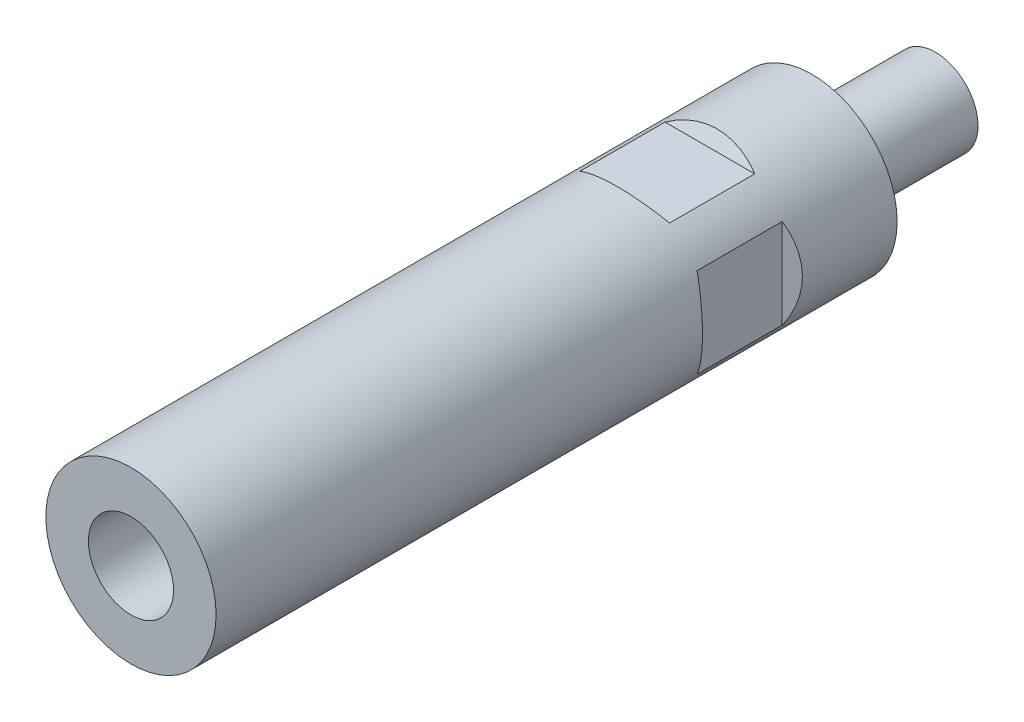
ISO-10303-21;
HEADER;
FILE_DESCRIPTION(('STEP AP214'),'2;1');
FILE_NAME('part.step','',(''),(''),'','','');
FILE_SCHEMA(('AUTOMOTIVE_DESIGN { 1 0 10303 214 1 1 1 1 }'));
ENDSEC;
DATA;
#1=APPLICATION_CONTEXT('core data for automotive mechanical design processes');
#2=APPLICATION_PROTOCOL_DEFINITION('international standard','automotive_design',2000,#1);
#3=PRODUCT_CONTEXT('',#1,'mechanical');
#4=PRODUCT('Part','Part','',(#3));
#5=PRODUCT_RELATED_PRODUCT_CATEGORY('part','',(#4));
#6=PRODUCT_DEFINITION_FORMATION('','',#4);
#7=PRODUCT_DEFINITION_CONTEXT('part definition',#1,'design');
#8=PRODUCT_DEFINITION('design','',#6,#7);
#9=PRODUCT_DEFINITION_SHAPE('','',#8);
#10=(LENGTH_UNIT() NAMED_UNIT(*) SI_UNIT(.MILLI.,.METRE.));
#11=(NAMED_UNIT(*) PLANE_ANGLE_UNIT() SI_UNIT($,.RADIAN.));
#12=(NAMED_UNIT(*) SI_UNIT($,.STERADIAN.) SOLID_ANGLE_UNIT());
#13=UNCERTAINTY_MEASURE_WITH_UNIT(LENGTH_MEASURE(1.E-05),#10,'distance_accuracy_value','');
#14=(GEOMETRIC_REPRESENTATION_CONTEXT(3) GLOBAL_UNCERTAINTY_ASSIGNED_CONTEXT((#13)) GLOBAL_UNIT_ASSIGNED_CONTEXT((#10,
#11,#12)) REPRESENTATION_CONTEXT('',''));
#15=CARTESIAN_POINT('',(0.,0.,0.));
#16=DIRECTION('',(0.,0.,1.));
#17=DIRECTION('',(1.,0.,0.));
#18=AXIS2_PLACEMENT_3D('',#15,#16,#17);
#19=CARTESIAN_POINT('',(0.,0.,5.5));
#20=DIRECTION('',(0.,0.,1.));
#21=DIRECTION('',(0.,-1.,0.));
#22=AXIS2_PLACEMENT_3D('',#19,#20,#21);
#23=CYLINDRICAL_SURFACE('',#22,5.);
#24=CARTESIAN_POINT('',(0.,0.,-14.5));
#25=DIRECTION('',(0.,0.,1.));
#26=DIRECTION('',(0.,-1.,0.));
#27=AXIS2_PLACEMENT_3D('',#24,#25,#26);
#28=CIRCLE('',#27,5.);
#29=CARTESIAN_POINT('',(0.,-5.,-14.5));
#30=VERTEX_POINT('',#29);
#31=EDGE_CURVE('E22',#30,#30,#28,.F.);
#32=ORIENTED_EDGE('',*,*,#31,.F.);
#33=EDGE_LOOP('',(#32));
#34=FACE_BOUND('',#33,.T.);
#35=CARTESIAN_POINT('',(0.,0.,0.));
#36=DIRECTION('',(0.,0.,1.));
#37=DIRECTION('',(1.,0.,0.));
#38=AXIS2_PLACEMENT_3D('',#35,#36,#37);
#39=CIRCLE('',#38,5.);
#40=CARTESIAN_POINT('',(5.,0.,0.));
#41=VERTEX_POINT('',#40);
#42=EDGE_CURVE('E9',#41,#41,#39,.T.);
#43=ORIENTED_EDGE('',*,*,#42,.F.);
#44=EDGE_LOOP('',(#43));
#45=FACE_BOUND('',#44,.T.);
#46=ADVANCED_FACE('F14',(#34,#45),#23,.T.);
#47=CARTESIAN_POINT('',(0.,0.,-14.5));
#48=DIRECTION('',(0.,0.,1.));
#49=DIRECTION('',(0.,-1.,0.));
#50=AXIS2_PLACEMENT_3D('',#47,#48,#49);
#51=PLANE('',#50);
#52=ORIENTED_EDGE('',*,*,#31,.T.);
#53=EDGE_LOOP('',(#52));
#54=FACE_BOUND('',#53,.T.);
#55=ADVANCED_FACE('F16',(#54),#51,.F.);
#56=CARTESIAN_POINT('',(4.25,4.36432032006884E-13,55.));
#57=DIRECTION('',(0.,0.,-1.));
#58=DIRECTION('',(-1.,0.,0.));
#59=AXIS2_PLACEMENT_3D('',#56,#57,#58);
#60=PLANE('',#59);
#61=CARTESIAN_POINT('',(0.,4.36432032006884E-13,55.));
#62=DIRECTION('',(0.,0.,1.));
#63=DIRECTION('',(1.,0.,0.));
#64=AXIS2_PLACEMENT_3D('',#61,#62,#63);
#65=CIRCLE('',#64,5.);
#66=CARTESIAN_POINT('',(5.,4.36432032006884E-13,55.));
#67=VERTEX_POINT('',#66);
#68=EDGE_CURVE('E251',#67,#67,#65,.T.);
#69=ORIENTED_EDGE('',*,*,#68,.T.);
#70=EDGE_LOOP('',(#69));
#71=FACE_BOUND('',#70,.T.);
#72=ADVANCED_FACE('F125',(#71),#60,.F.);
#73=CARTESIAN_POINT('',(0.,4.36432032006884E-13,80.));
#74=DIRECTION('',(0.,0.,1.));
#75=DIRECTION('',(1.,0.,0.));
#76=AXIS2_PLACEMENT_3D('',#73,#74,#75);
#77=CYLINDRICAL_SURFACE('',#76,5.);
#78=ORIENTED_EDGE('',*,*,#68,.F.);
#79=EDGE_LOOP('',(#78));
#80=FACE_BOUND('',#79,.T.);
#81=CARTESIAN_POINT('',(0.,4.36432032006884E-13,80.));
#82=DIRECTION('',(0.,0.,1.));
#83=DIRECTION('',(1.,0.,0.));
#84=AXIS2_PLACEMENT_3D('',#81,#82,#83);
#85=CIRCLE('',#84,5.);
#86=CARTESIAN_POINT('',(5.,4.36432032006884E-13,80.));
#87=VERTEX_POINT('',#86);
#88=EDGE_CURVE('E96',#87,#87,#85,.T.);
#89=ORIENTED_EDGE('',*,*,#88,.T.);
#90=EDGE_LOOP('',(#89));
#91=FACE_BOUND('',#90,.T.);
#92=ADVANCED_FACE('F127',(#80,#91),#77,.F.);
#93=CARTESIAN_POINT('',(0.,0.,80.));
#94=DIRECTION('',(0.,0.,1.));
#95=DIRECTION('',(1.,0.,0.));
#96=AXIS2_PLACEMENT_3D('',#93,#94,#95);
#97=PLANE('',#96);
#98=ORIENTED_EDGE('',*,*,#88,.F.);
#99=EDGE_LOOP('',(#98));
#100=FACE_BOUND('',#99,.T.);
#101=CARTESIAN_POINT('',(0.,0.,80.));
#102=DIRECTION('',(0.,0.,1.));
#103=DIRECTION('',(1.,0.,0.));
#104=AXIS2_PLACEMENT_3D('',#101,#102,#103);
#105=CIRCLE('',#104,10.);
#106=CARTESIAN_POINT('',(10.,0.,80.));
#107=VERTEX_POINT('',#106);
#108=EDGE_CURVE('E239',#107,#107,#105,.T.);
#109=ORIENTED_EDGE('',*,*,#108,.T.);
#110=EDGE_LOOP('',(#109));
#111=FACE_BOUND('',#110,.T.);
#112=ADVANCED_FACE('F134',(#100,#111),#97,.T.);
#113=CARTESIAN_POINT('',(8.5,-10.,22.));
#114=DIRECTION('',(-0.5,0.,0.866025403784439));
#115=DIRECTION('',(0.866025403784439,0.,0.5));
#116=AXIS2_PLACEMENT_3D('',#113,#114,#115);
#117=PLANE('',#116);
#118=DIRECTION('',(0.,1.,0.));
#119=VECTOR('',#118,1.);
#120=CARTESIAN_POINT('',(8.5,-10.,22.));
#121=LINE('',#120,#119);
#122=CARTESIAN_POINT('',(8.5,-5.26782687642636,22.));
#123=VERTEX_POINT('',#122);
#124=CARTESIAN_POINT('',(8.5,5.26782687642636,22.));
#125=VERTEX_POINT('',#124);
#126=EDGE_CURVE('E183',#123,#125,#121,.T.);
#127=ORIENTED_EDGE('',*,*,#126,.T.);
#128=CARTESIAN_POINT('',(0.,0.,17.0925227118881));
#129=DIRECTION('',(-0.5,0.,0.866025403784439));
#130=DIRECTION('',(-0.866025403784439,0.,-0.5));
#131=AXIS2_PLACEMENT_3D('',#128,#129,#130);
#132=ELLIPSE('',#131,11.5470053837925,10.);
#133=EDGE_CURVE('E35',#123,#125,#132,.T.);
#134=ORIENTED_EDGE('',*,*,#133,.F.);
#135=EDGE_LOOP('',(#127,#134));
#136=FACE_BOUND('',#135,.T.);
#137=ADVANCED_FACE('F175',(#136),#117,.F.);
#138=CARTESIAN_POINT('',(8.5,-10.,22.));
#139=DIRECTION('',(-1.,0.,0.));
#140=DIRECTION('',(0.,0.,1.));
#141=AXIS2_PLACEMENT_3D('',#138,#139,#140);
#142=PLANE('',#141);
#143=ORIENTED_EDGE('',*,*,#126,.F.);
#144=DIRECTION('',(0.,0.,-1.));
#145=VECTOR('',#144,1.);
#146=CARTESIAN_POINT('',(8.5,-5.26782687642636,80.));
#147=LINE('',#146,#145);
#148=CARTESIAN_POINT('',(8.5,-5.26782687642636,12.));
#149=VERTEX_POINT('',#148);
#150=EDGE_CURVE('E191',#149,#123,#147,.F.);
#151=ORIENTED_EDGE('',*,*,#150,.F.);
#152=DIRECTION('',(0.,1.,0.));
#153=VECTOR('',#152,1.);
#154=CARTESIAN_POINT('',(8.5,-10.,12.));
#155=LINE('',#154,#153);
#156=CARTESIAN_POINT('',(8.5,5.26782687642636,12.));
#157=VERTEX_POINT('',#156);
#158=EDGE_CURVE('E187',#149,#157,#155,.T.);
#159=ORIENTED_EDGE('',*,*,#158,.T.);
#160=DIRECTION('',(0.,0.,-1.));
#161=VECTOR('',#160,1.);
#162=CARTESIAN_POINT('',(8.5,5.26782687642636,80.));
#163=LINE('',#162,#161);
#164=EDGE_CURVE('E29',#125,#157,#163,.T.);
#165=ORIENTED_EDGE('',*,*,#164,.F.);
#166=EDGE_LOOP('',(#143,#151,#159,#165));
#167=FACE_BOUND('',#166,.T.);
#168=ADVANCED_FACE('F172',(#167),#142,.F.);
#169=CARTESIAN_POINT('',(8.5,-10.,12.));
#170=DIRECTION('',(-0.5,0.,-0.866025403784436));
#171=DIRECTION('',(-0.866025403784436,0.,0.5));
#172=AXIS2_PLACEMENT_3D('',#169,#170,#171);
#173=PLANE('',#172);
#174=CARTESIAN_POINT('',(0.,0.,16.9074772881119));
#175=DIRECTION('',(-0.5,0.,-0.866025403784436));
#176=DIRECTION('',(0.866025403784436,0.,-0.5));
#177=AXIS2_PLACEMENT_3D('',#174,#175,#176);
#178=ELLIPSE('',#177,11.5470053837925,10.);
#179=EDGE_CURVE('E195',#157,#149,#178,.T.);
#180=ORIENTED_EDGE('',*,*,#179,.F.);
#181=ORIENTED_EDGE('',*,*,#158,.F.);
#182=EDGE_LOOP('',(#180,#181));
#183=FACE_BOUND('',#182,.T.);
#184=ADVANCED_FACE('F167',(#183),#173,.F.);
#185=CARTESIAN_POINT('',(-8.5,-10.,12.));
#186=DIRECTION('',(0.5,0.,-0.866025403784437));
#187=DIRECTION('',(-0.866025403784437,0.,-0.5));
#188=AXIS2_PLACEMENT_3D('',#185,#186,#187);
#189=PLANE('',#188);
#190=CARTESIAN_POINT('',(0.,0.,16.9074772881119));
#191=DIRECTION('',(0.5,0.,-0.866025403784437));
#192=DIRECTION('',(-0.866025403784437,0.,-0.5));
#193=AXIS2_PLACEMENT_3D('',#190,#191,#192);
#194=ELLIPSE('',#193,11.5470053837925,10.);
#195=CARTESIAN_POINT('',(-8.5,-5.26782687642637,12.));
#196=VERTEX_POINT('',#195);
#197=CARTESIAN_POINT('',(-8.5,5.26782687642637,12.));
#198=VERTEX_POINT('',#197);
#199=EDGE_CURVE('E193',#196,#198,#194,.T.);
#200=ORIENTED_EDGE('',*,*,#199,.F.);
#201=DIRECTION('',(0.,1.,0.));
#202=VECTOR('',#201,1.);
#203=CARTESIAN_POINT('',(-8.5,-10.,12.));
#204=LINE('',#203,#202);
#205=EDGE_CURVE('E227',#196,#198,#204,.T.);
#206=ORIENTED_EDGE('',*,*,#205,.T.);
#207=EDGE_LOOP('',(#200,#206));
#208=FACE_BOUND('',#207,.T.);
#209=ADVANCED_FACE('F163',(#208),#189,.F.);
#210=CARTESIAN_POINT('',(-8.5,-10.,22.));
#211=DIRECTION('',(0.5,0.,0.866025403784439));
#212=DIRECTION('',(0.866025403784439,0.,-0.5));
#213=AXIS2_PLACEMENT_3D('',#210,#211,#212);
#214=PLANE('',#213);
#215=DIRECTION('',(0.,1.,0.));
#216=VECTOR('',#215,1.);
#217=CARTESIAN_POINT('',(-8.5,-10.,22.));
#218=LINE('',#217,#216);
#219=CARTESIAN_POINT('',(-8.5,-5.26782687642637,22.));
#220=VERTEX_POINT('',#219);
#221=CARTESIAN_POINT('',(-8.5,5.26782687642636,22.));
#222=VERTEX_POINT('',#221);
#223=EDGE_CURVE('E231',#220,#222,#218,.T.);
#224=ORIENTED_EDGE('',*,*,#223,.F.);
#225=CARTESIAN_POINT('',(0.,0.,17.0925227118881));
#226=DIRECTION('',(0.5,0.,0.866025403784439));
#227=DIRECTION('',(0.866025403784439,0.,-0.5));
#228=AXIS2_PLACEMENT_3D('',#225,#226,#227);
#229=ELLIPSE('',#228,11.5470053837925,10.);
#230=EDGE_CURVE('E206',#222,#220,#229,.T.);
#231=ORIENTED_EDGE('',*,*,#230,.F.);
#232=EDGE_LOOP('',(#224,#231));
#233=FACE_BOUND('',#232,.T.);
#234=ADVANCED_FACE('F160',(#233),#214,.F.);
#235=CARTESIAN_POINT('',(-8.5,-10.,22.));
#236=DIRECTION('',(1.,0.,0.));
#237=DIRECTION('',(0.,0.,-1.));
#238=AXIS2_PLACEMENT_3D('',#235,#236,#237);
#239=PLANE('',#238);
#240=ORIENTED_EDGE('',*,*,#223,.T.);
#241=DIRECTION('',(0.,0.,-1.));
#242=VECTOR('',#241,1.);
#243=CARTESIAN_POINT('',(-8.5,5.26782687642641,80.));
#244=LINE('',#243,#242);
#245=EDGE_CURVE('E200',#198,#222,#244,.F.);
#246=ORIENTED_EDGE('',*,*,#245,.F.);
#247=ORIENTED_EDGE('',*,*,#205,.F.);
#248=DIRECTION('',(0.,0.,-1.));
#249=VECTOR('',#248,1.);
#250=CARTESIAN_POINT('',(-8.5,-5.26782687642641,80.));
#251=LINE('',#250,#249);
#252=EDGE_CURVE('E203',#220,#196,#251,.T.);
#253=ORIENTED_EDGE('',*,*,#252,.F.);
#254=EDGE_LOOP('',(#240,#246,#247,#253));
#255=FACE_BOUND('',#254,.T.);
#256=ADVANCED_FACE('F158',(#255),#239,.F.);
#257=CARTESIAN_POINT('',(10.,8.5,22.));
#258=DIRECTION('',(0.,-0.5,0.866025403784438));
#259=DIRECTION('',(0.,-0.866025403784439,-0.5));
#260=AXIS2_PLACEMENT_3D('',#257,#258,#259);
#261=PLANE('',#260);
#262=DIRECTION('',(-1.,0.,0.));
#263=VECTOR('',#262,1.);
#264=CARTESIAN_POINT('',(10.,8.5,22.));
#265=LINE('',#264,#263);
#266=CARTESIAN_POINT('',(5.26782687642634,8.5,22.));
#267=VERTEX_POINT('',#266);
#268=CARTESIAN_POINT('',(-5.26782687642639,8.5,22.));
#269=VERTEX_POINT('',#268);
#270=EDGE_CURVE('E225',#267,#269,#265,.T.);
#271=ORIENTED_EDGE('',*,*,#270,.T.);
#272=CARTESIAN_POINT('',(0.,0.,17.0925227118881));
#273=DIRECTION('',(0.,-0.5,0.866025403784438));
#274=DIRECTION('',(0.,-0.866025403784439,-0.5));
#275=AXIS2_PLACEMENT_3D('',#272,#273,#274);
#276=ELLIPSE('',#275,11.5470053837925,10.);
#277=EDGE_CURVE('E214',#267,#269,#276,.T.);
#278=ORIENTED_EDGE('',*,*,#277,.F.);
#279=EDGE_LOOP('',(#271,#278));
#280=FACE_BOUND('',#279,.T.);
#281=ADVANCED_FACE('F151',(#280),#261,.F.);
#282=CARTESIAN_POINT('',(10.,8.5,22.));
#283=DIRECTION('',(0.,-1.,0.));
#284=DIRECTION('',(1.,0.,0.));
#285=AXIS2_PLACEMENT_3D('',#282,#283,#284);
#286=PLANE('',#285);
#287=ORIENTED_EDGE('',*,*,#270,.F.);
#288=DIRECTION('',(0.,0.,-1.));
#289=VECTOR('',#288,1.);
#290=CARTESIAN_POINT('',(5.26782687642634,8.5,80.));
#291=LINE('',#290,#289);
#292=CARTESIAN_POINT('',(5.26782687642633,8.5,12.));
#293=VERTEX_POINT('',#292);
#294=EDGE_CURVE('E88',#293,#267,#291,.F.);
#295=ORIENTED_EDGE('',*,*,#294,.F.);
#296=DIRECTION('',(-1.,0.,0.));
#297=VECTOR('',#296,1.);
#298=CARTESIAN_POINT('',(10.,8.5,12.));
#299=LINE('',#298,#297);
#300=CARTESIAN_POINT('',(-5.26782687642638,8.5,12.));
#301=VERTEX_POINT('',#300);
#302=EDGE_CURVE('E223',#293,#301,#299,.T.);
#303=ORIENTED_EDGE('',*,*,#302,.T.);
#304=DIRECTION('',(0.,0.,-1.));
#305=VECTOR('',#304,1.);
#306=CARTESIAN_POINT('',(-5.2678268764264,8.5,80.));
#307=LINE('',#306,#305);
#308=EDGE_CURVE('E211',#269,#301,#307,.T.);
#309=ORIENTED_EDGE('',*,*,#308,.F.);
#310=EDGE_LOOP('',(#287,#295,#303,#309));
#311=FACE_BOUND('',#310,.T.);
#312=ADVANCED_FACE('F148',(#311),#286,.F.);
#313=CARTESIAN_POINT('',(10.,8.5,12.));
#314=DIRECTION('',(0.,-0.5,-0.866025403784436));
#315=DIRECTION('',(0.,0.866025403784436,-0.5));
#316=AXIS2_PLACEMENT_3D('',#313,#314,#315);
#317=PLANE('',#316);
#318=CARTESIAN_POINT('',(0.,0.,16.9074772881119));
#319=DIRECTION('',(0.,-0.5,-0.866025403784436));
#320=DIRECTION('',(0.,0.866025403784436,-0.5));
#321=AXIS2_PLACEMENT_3D('',#318,#319,#320);
#322=ELLIPSE('',#321,11.5470053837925,10.);
#323=EDGE_CURVE('E209',#301,#293,#322,.T.);
#324=ORIENTED_EDGE('',*,*,#323,.F.);
#325=ORIENTED_EDGE('',*,*,#302,.F.);
#326=EDGE_LOOP('',(#324,#325));
#327=FACE_BOUND('',#326,.T.);
#328=ADVANCED_FACE('F145',(#327),#317,.F.);
#329=CARTESIAN_POINT('',(10.,-8.5,12.));
#330=DIRECTION('',(0.,0.5,-0.866025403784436));
#331=DIRECTION('',(0.,0.866025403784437,0.5));
#332=AXIS2_PLACEMENT_3D('',#329,#330,#331);
#333=PLANE('',#332);
#334=CARTESIAN_POINT('',(0.,0.,16.9074772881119));
#335=DIRECTION('',(0.,0.5,-0.866025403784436));
#336=DIRECTION('',(0.,-0.866025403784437,-0.5));
#337=AXIS2_PLACEMENT_3D('',#334,#335,#336);
#338=ELLIPSE('',#337,11.5470053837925,10.);
#339=CARTESIAN_POINT('',(5.2678268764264,-8.5,12.));
#340=VERTEX_POINT('',#339);
#341=CARTESIAN_POINT('',(-5.26782687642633,-8.5,12.));
#342=VERTEX_POINT('',#341);
#343=EDGE_CURVE('E79',#340,#342,#338,.T.);
#344=ORIENTED_EDGE('',*,*,#343,.F.);
#345=DIRECTION('',(-1.,0.,0.));
#346=VECTOR('',#345,1.);
#347=CARTESIAN_POINT('',(10.,-8.5,12.));
#348=LINE('',#347,#346);
#349=EDGE_CURVE('E82',#340,#342,#348,.T.);
#350=ORIENTED_EDGE('',*,*,#349,.T.);
#351=EDGE_LOOP('',(#344,#350));
#352=FACE_BOUND('',#351,.T.);
#353=ADVANCED_FACE('F81',(#352),#333,.F.);
#354=CARTESIAN_POINT('',(10.,-8.5,22.));
#355=DIRECTION('',(0.,0.5,0.866025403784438));
#356=DIRECTION('',(0.,-0.866025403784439,0.5));
#357=AXIS2_PLACEMENT_3D('',#354,#355,#356);
#358=PLANE('',#357);
#359=DIRECTION('',(-1.,0.,0.));
#360=VECTOR('',#359,1.);
#361=CARTESIAN_POINT('',(10.,-8.5,22.));
#362=LINE('',#361,#360);
#363=CARTESIAN_POINT('',(5.26782687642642,-8.5,22.));
#364=VERTEX_POINT('',#363);
#365=CARTESIAN_POINT('',(-5.26782687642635,-8.5,22.));
#366=VERTEX_POINT('',#365);
#367=EDGE_CURVE('E95',#364,#366,#362,.T.);
#368=ORIENTED_EDGE('',*,*,#367,.F.);
#369=CARTESIAN_POINT('',(0.,0.,17.0925227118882));
#370=DIRECTION('',(0.,0.5,0.866025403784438));
#371=DIRECTION('',(0.,0.866025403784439,-0.5));
#372=AXIS2_PLACEMENT_3D('',#369,#370,#371);
#373=ELLIPSE('',#372,11.5470053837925,10.);
#374=EDGE_CURVE('E101',#366,#364,#373,.T.);
#375=ORIENTED_EDGE('',*,*,#374,.F.);
#376=EDGE_LOOP('',(#368,#375));
#377=FACE_BOUND('',#376,.T.);
#378=ADVANCED_FACE('F139',(#377),#358,.F.);
#379=CARTESIAN_POINT('',(10.,-8.5,22.));
#380=DIRECTION('',(0.,1.,0.));
#381=DIRECTION('',(-1.,0.,0.));
#382=AXIS2_PLACEMENT_3D('',#379,#380,#381);
#383=PLANE('',#382);
#384=ORIENTED_EDGE('',*,*,#367,.T.);
#385=DIRECTION('',(0.,0.,-1.));
#386=VECTOR('',#385,1.);
#387=CARTESIAN_POINT('',(-5.26782687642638,-8.5,80.));
#388=LINE('',#387,#386);
#389=EDGE_CURVE('E87',#342,#366,#388,.F.);
#390=ORIENTED_EDGE('',*,*,#389,.F.);
#391=ORIENTED_EDGE('',*,*,#349,.F.);
#392=DIRECTION('',(0.,0.,-1.));
#393=VECTOR('',#392,1.);
#394=CARTESIAN_POINT('',(5.26782687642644,-8.5,80.));
#395=LINE('',#394,#393);
#396=EDGE_CURVE('E93',#364,#340,#395,.T.);
#397=ORIENTED_EDGE('',*,*,#396,.F.);
#398=EDGE_LOOP('',(#384,#390,#391,#397));
#399=FACE_BOUND('',#398,.T.);
#400=ADVANCED_FACE('F92',(#399),#383,.F.);
#401=CARTESIAN_POINT('',(0.,0.,80.));
#402=DIRECTION('',(0.,0.,-1.));
#403=DIRECTION('',(-1.,0.,0.));
#404=AXIS2_PLACEMENT_3D('',#401,#402,#403);
#405=CYLINDRICAL_SURFACE('',#404,10.);
#406=ORIENTED_EDGE('',*,*,#389,.T.);
#407=ORIENTED_EDGE('',*,*,#374,.T.);
#408=ORIENTED_EDGE('',*,*,#396,.T.);
#409=ORIENTED_EDGE('',*,*,#343,.T.);
#410=EDGE_LOOP('',(#406,#407,#408,#409));
#411=FACE_BOUND('',#410,.T.);
#412=ORIENTED_EDGE('',*,*,#323,.T.);
#413=ORIENTED_EDGE('',*,*,#294,.T.);
#414=ORIENTED_EDGE('',*,*,#277,.T.);
#415=ORIENTED_EDGE('',*,*,#308,.T.);
#416=EDGE_LOOP('',(#412,#413,#414,#415));
#417=FACE_BOUND('',#416,.T.);
#418=ORIENTED_EDGE('',*,*,#245,.T.);
#419=ORIENTED_EDGE('',*,*,#230,.T.);
#420=ORIENTED_EDGE('',*,*,#252,.T.);
#421=ORIENTED_EDGE('',*,*,#199,.T.);
#422=EDGE_LOOP('',(#418,#419,#420,#421));
#423=FACE_BOUND('',#422,.T.);
#424=ORIENTED_EDGE('',*,*,#179,.T.);
#425=ORIENTED_EDGE('',*,*,#150,.T.);
#426=ORIENTED_EDGE('',*,*,#133,.T.);
#427=ORIENTED_EDGE('',*,*,#164,.T.);
#428=EDGE_LOOP('',(#424,#425,#426,#427));
#429=FACE_BOUND('',#428,.T.);
#430=ORIENTED_EDGE('',*,*,#108,.F.);
#431=EDGE_LOOP('',(#430));
#432=FACE_BOUND('',#431,.T.);
#433=CARTESIAN_POINT('',(0.,0.,0.));
#434=DIRECTION('',(0.,0.,1.));
#435=DIRECTION('',(1.,0.,0.));
#436=AXIS2_PLACEMENT_3D('',#433,#434,#435);
#437=CIRCLE('',#436,10.);
#438=CARTESIAN_POINT('',(10.,0.,0.));
#439=VERTEX_POINT('',#438);
#440=EDGE_CURVE('E186',#439,#439,#437,.T.);
#441=ORIENTED_EDGE('',*,*,#440,.T.);
#442=EDGE_LOOP('',(#441));
#443=FACE_BOUND('',#442,.T.);
#444=ADVANCED_FACE('F99',(#411,#417,#423,#429,#432,#443),#405,.T.);
#445=CARTESIAN_POINT('',(0.,0.,0.));
#446=DIRECTION('',(0.,0.,1.));
#447=DIRECTION('',(1.,0.,0.));
#448=AXIS2_PLACEMENT_3D('',#445,#446,#447);
#449=PLANE('',#448);
#450=ORIENTED_EDGE('',*,*,#440,.F.);
#451=EDGE_LOOP('',(#450));
#452=FACE_BOUND('',#451,.T.);
#453=ORIENTED_EDGE('',*,*,#42,.T.);
#454=EDGE_LOOP('',(#453));
#455=FACE_BOUND('',#454,.T.);
#456=ADVANCED_FACE('F111',(#452,#455),#449,.F.);
#457=CLOSED_SHELL('',(#46,#55,#72,#92,#112,#137,#168,#184,#209,#234,#256,#281,#312,#328,#353,
#378,#400,#444,#456));
#458=MANIFOLD_SOLID_BREP('B1',#457);
#459=ADVANCED_BREP_SHAPE_REPRESENTATION('',(#18,#458),#14);
#460=SHAPE_DEFINITION_REPRESENTATION(#9,#459);
ENDSEC;
END-ISO-10303-21;
